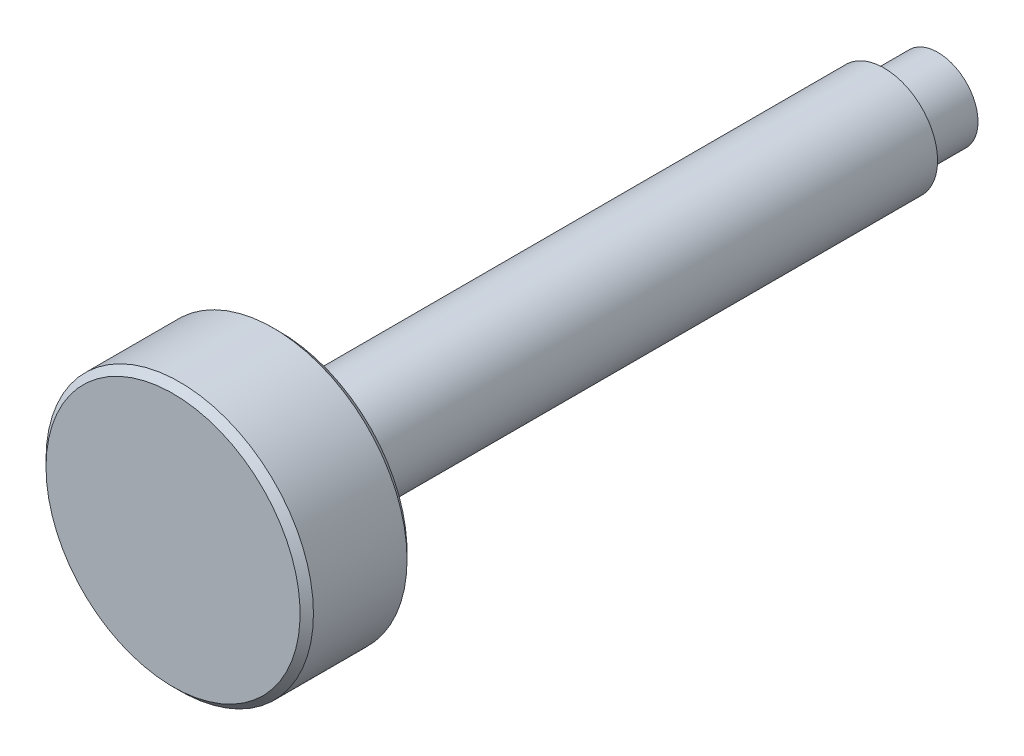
ISO-10303-21;
HEADER;
FILE_DESCRIPTION(('STEP AP214'),'2;1');
FILE_NAME('part.step','',(''),(''),'','','');
FILE_SCHEMA(('AUTOMOTIVE_DESIGN { 1 0 10303 214 1 1 1 1 }'));
ENDSEC;
DATA;
#1=APPLICATION_CONTEXT('core data for automotive mechanical design processes');
#2=APPLICATION_PROTOCOL_DEFINITION('international standard','automotive_design',2000,#1);
#3=PRODUCT_CONTEXT('',#1,'mechanical');
#4=PRODUCT('Part','Part','',(#3));
#5=PRODUCT_RELATED_PRODUCT_CATEGORY('part','',(#4));
#6=PRODUCT_DEFINITION_FORMATION('','',#4);
#7=PRODUCT_DEFINITION_CONTEXT('part definition',#1,'design');
#8=PRODUCT_DEFINITION('design','',#6,#7);
#9=PRODUCT_DEFINITION_SHAPE('','',#8);
#10=(LENGTH_UNIT() NAMED_UNIT(*) SI_UNIT(.MILLI.,.METRE.));
#11=(NAMED_UNIT(*) PLANE_ANGLE_UNIT() SI_UNIT($,.RADIAN.));
#12=(NAMED_UNIT(*) SI_UNIT($,.STERADIAN.) SOLID_ANGLE_UNIT());
#13=UNCERTAINTY_MEASURE_WITH_UNIT(LENGTH_MEASURE(1.E-05),#10,'distance_accuracy_value','');
#14=(GEOMETRIC_REPRESENTATION_CONTEXT(3) GLOBAL_UNCERTAINTY_ASSIGNED_CONTEXT((#13)) GLOBAL_UNIT_ASSIGNED_CONTEXT((#10,
#11,#12)) REPRESENTATION_CONTEXT('',''));
#15=CARTESIAN_POINT('',(0.,0.,0.));
#16=DIRECTION('',(0.,0.,1.));
#17=DIRECTION('',(1.,0.,0.));
#18=AXIS2_PLACEMENT_3D('',#15,#16,#17);
#19=CARTESIAN_POINT('',(0.,0.,100.));
#20=DIRECTION('',(0.,0.,1.));
#21=DIRECTION('',(1.,0.,0.));
#22=AXIS2_PLACEMENT_3D('',#19,#20,#21);
#23=CYLINDRICAL_SURFACE('',#22,20.);
#24=CARTESIAN_POINT('',(0.,0.,115.));
#25=DIRECTION('',(0.,0.,-1.));
#26=DIRECTION('',(-1.,0.,0.));
#27=AXIS2_PLACEMENT_3D('',#24,#25,#26);
#28=CIRCLE('',#27,20.);
#29=CARTESIAN_POINT('',(-20.,0.,115.));
#30=VERTEX_POINT('',#29);
#31=EDGE_CURVE('E23',#30,#30,#28,.T.);
#32=ORIENTED_EDGE('',*,*,#31,.T.);
#33=EDGE_LOOP('',(#32));
#34=FACE_BOUND('',#33,.T.);
#35=CARTESIAN_POINT('',(0.,0.,101.));
#36=DIRECTION('',(0.,0.,-1.));
#37=DIRECTION('',(-1.,0.,0.));
#38=AXIS2_PLACEMENT_3D('',#35,#36,#37);
#39=CIRCLE('',#38,20.);
#40=CARTESIAN_POINT('',(-20.,0.,101.));
#41=VERTEX_POINT('',#40);
#42=EDGE_CURVE('E27',#41,#41,#39,.F.);
#43=ORIENTED_EDGE('',*,*,#42,.T.);
#44=EDGE_LOOP('',(#43));
#45=FACE_BOUND('',#44,.T.);
#46=ADVANCED_FACE('F12',(#34,#45),#23,.T.);
#47=CARTESIAN_POINT('',(0.,0.,100.));
#48=DIRECTION('',(0.,0.,-1.));
#49=DIRECTION('',(-1.,0.,0.));
#50=AXIS2_PLACEMENT_3D('',#47,#48,#49);
#51=PLANE('',#50);
#52=CARTESIAN_POINT('',(0.,0.,100.));
#53=DIRECTION('',(0.,0.,-1.));
#54=DIRECTION('',(-1.,0.,0.));
#55=AXIS2_PLACEMENT_3D('',#52,#53,#54);
#56=CIRCLE('',#55,19.);
#57=CARTESIAN_POINT('',(-19.,0.,100.));
#58=VERTEX_POINT('',#57);
#59=EDGE_CURVE('E8',#58,#58,#56,.T.);
#60=ORIENTED_EDGE('',*,*,#59,.T.);
#61=EDGE_LOOP('',(#60));
#62=FACE_BOUND('',#61,.T.);
#63=CARTESIAN_POINT('',(0.,0.,100.));
#64=DIRECTION('',(0.,0.,-1.));
#65=DIRECTION('',(-1.,0.,0.));
#66=AXIS2_PLACEMENT_3D('',#63,#64,#65);
#67=CIRCLE('',#66,8.6);
#68=CARTESIAN_POINT('',(-8.6,0.,100.));
#69=VERTEX_POINT('',#68);
#70=EDGE_CURVE('E32',#69,#69,#67,.F.);
#71=ORIENTED_EDGE('',*,*,#70,.T.);
#72=EDGE_LOOP('',(#71));
#73=FACE_BOUND('',#72,.T.);
#74=ADVANCED_FACE('F66',(#62,#73),#51,.T.);
#75=CARTESIAN_POINT('',(0.,0.,116.));
#76=DIRECTION('',(0.,0.,-1.));
#77=DIRECTION('',(-1.,0.,0.));
#78=AXIS2_PLACEMENT_3D('',#75,#76,#77);
#79=PLANE('',#78);
#80=CARTESIAN_POINT('',(0.,0.,116.));
#81=DIRECTION('',(0.,0.,-1.));
#82=DIRECTION('',(-1.,0.,0.));
#83=AXIS2_PLACEMENT_3D('',#80,#81,#82);
#84=CIRCLE('',#83,19.);
#85=CARTESIAN_POINT('',(-19.,0.,116.));
#86=VERTEX_POINT('',#85);
#87=EDGE_CURVE('E19',#86,#86,#84,.F.);
#88=ORIENTED_EDGE('',*,*,#87,.T.);
#89=EDGE_LOOP('',(#88));
#90=FACE_BOUND('',#89,.T.);
#91=ADVANCED_FACE('F72',(#90),#79,.F.);
#92=CARTESIAN_POINT('',(0.,0.,100.));
#93=DIRECTION('',(0.,0.,1.));
#94=DIRECTION('',(1.,0.,0.));
#95=AXIS2_PLACEMENT_3D('',#92,#93,#94);
#96=CYLINDRICAL_SURFACE('',#95,8.);
#97=CARTESIAN_POINT('',(0.,0.,99.4));
#98=DIRECTION('',(0.,0.,-1.));
#99=DIRECTION('',(-1.,0.,0.));
#100=AXIS2_PLACEMENT_3D('',#97,#98,#99);
#101=CIRCLE('',#100,8.);
#102=CARTESIAN_POINT('',(-8.,0.,99.4));
#103=VERTEX_POINT('',#102);
#104=EDGE_CURVE('E35',#103,#103,#101,.T.);
#105=ORIENTED_EDGE('',*,*,#104,.T.);
#106=EDGE_LOOP('',(#105));
#107=FACE_BOUND('',#106,.T.);
#108=CARTESIAN_POINT('',(0.,0.,9.65470053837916));
#109=DIRECTION('',(0.,0.,1.));
#110=DIRECTION('',(1.,0.,0.));
#111=AXIS2_PLACEMENT_3D('',#108,#109,#110);
#112=CIRCLE('',#111,8.);
#113=CARTESIAN_POINT('',(8.,0.,9.65470053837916));
#114=VERTEX_POINT('',#113);
#115=EDGE_CURVE('E38',#114,#114,#112,.T.);
#116=ORIENTED_EDGE('',*,*,#115,.T.);
#117=EDGE_LOOP('',(#116));
#118=FACE_BOUND('',#117,.T.);
#119=ADVANCED_FACE('F125',(#107,#118),#96,.T.);
#120=CARTESIAN_POINT('',(0.,0.,9.65470053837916));
#121=DIRECTION('',(0.,0.,1.));
#122=DIRECTION('',(1.,0.,0.));
#123=AXIS2_PLACEMENT_3D('',#120,#121,#122);
#124=CONICAL_SURFACE('',#123,8.,1.0471975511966);
#125=CARTESIAN_POINT('',(0.,0.,8.5));
#126=DIRECTION('',(0.,0.,1.));
#127=DIRECTION('',(1.,0.,0.));
#128=AXIS2_PLACEMENT_3D('',#125,#126,#127);
#129=CIRCLE('',#128,6.);
#130=CARTESIAN_POINT('',(6.,0.,8.5));
#131=VERTEX_POINT('',#130);
#132=EDGE_CURVE('E41',#131,#131,#129,.T.);
#133=ORIENTED_EDGE('',*,*,#132,.T.);
#134=EDGE_LOOP('',(#133));
#135=FACE_BOUND('',#134,.T.);
#136=ORIENTED_EDGE('',*,*,#115,.F.);
#137=EDGE_LOOP('',(#136));
#138=FACE_BOUND('',#137,.T.);
#139=ADVANCED_FACE('F63',(#135,#138),#124,.T.);
#140=CARTESIAN_POINT('',(0.,0.,100.));
#141=DIRECTION('',(0.,0.,1.));
#142=DIRECTION('',(1.,0.,0.));
#143=AXIS2_PLACEMENT_3D('',#140,#141,#142);
#144=CYLINDRICAL_SURFACE('',#143,6.);
#145=CARTESIAN_POINT('',(0.,0.,1.60769515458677));
#146=DIRECTION('',(0.,0.,1.));
#147=DIRECTION('',(1.,0.,0.));
#148=AXIS2_PLACEMENT_3D('',#145,#146,#147);
#149=CIRCLE('',#148,6.);
#150=CARTESIAN_POINT('',(6.,0.,1.60769515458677));
#151=VERTEX_POINT('',#150);
#152=EDGE_CURVE('E44',#151,#151,#149,.T.);
#153=ORIENTED_EDGE('',*,*,#152,.T.);
#154=EDGE_LOOP('',(#153));
#155=FACE_BOUND('',#154,.T.);
#156=ORIENTED_EDGE('',*,*,#132,.F.);
#157=EDGE_LOOP('',(#156));
#158=FACE_BOUND('',#157,.T.);
#159=ADVANCED_FACE('F48',(#155,#158),#144,.T.);
#160=CARTESIAN_POINT('',(0.,0.,12.));
#161=DIRECTION('',(0.,0.,1.));
#162=DIRECTION('',(1.,0.,0.));
#163=AXIS2_PLACEMENT_3D('',#160,#161,#162);
#164=SPHERICAL_SURFACE('',#163,12.);
#165=ORIENTED_EDGE('',*,*,#152,.F.);
#166=EDGE_LOOP('',(#165));
#167=FACE_BOUND('',#166,.T.);
#168=ADVANCED_FACE('F51',(#167),#164,.T.);
#169=CARTESIAN_POINT('',(0.,0.,99.4));
#170=DIRECTION('',(0.,0.,-1.));
#171=DIRECTION('',(-1.,0.,0.));
#172=AXIS2_PLACEMENT_3D('',#169,#170,#171);
#173=TOROIDAL_SURFACE('',#172,8.6,0.6);
#174=ORIENTED_EDGE('',*,*,#70,.F.);
#175=EDGE_LOOP('',(#174));
#176=FACE_BOUND('',#175,.T.);
#177=ORIENTED_EDGE('',*,*,#104,.F.);
#178=EDGE_LOOP('',(#177));
#179=FACE_BOUND('',#178,.T.);
#180=ADVANCED_FACE('F53',(#176,#179),#173,.F.);
#181=CARTESIAN_POINT('',(0.,0.,115.));
#182=DIRECTION('',(0.,0.,-1.));
#183=DIRECTION('',(-1.,0.,0.));
#184=AXIS2_PLACEMENT_3D('',#181,#182,#183);
#185=CONICAL_SURFACE('',#184,20.,0.785398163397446);
#186=ORIENTED_EDGE('',*,*,#87,.F.);
#187=EDGE_LOOP('',(#186));
#188=FACE_BOUND('',#187,.T.);
#189=ORIENTED_EDGE('',*,*,#31,.F.);
#190=EDGE_LOOP('',(#189));
#191=FACE_BOUND('',#190,.T.);
#192=ADVANCED_FACE('F60',(#188,#191),#185,.T.);
#193=CARTESIAN_POINT('',(0.,0.,100.));
#194=DIRECTION('',(0.,0.,1.));
#195=DIRECTION('',(1.,0.,0.));
#196=AXIS2_PLACEMENT_3D('',#193,#194,#195);
#197=CONICAL_SURFACE('',#196,19.,0.78539816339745);
#198=ORIENTED_EDGE('',*,*,#42,.F.);
#199=EDGE_LOOP('',(#198));
#200=FACE_BOUND('',#199,.T.);
#201=ORIENTED_EDGE('',*,*,#59,.F.);
#202=EDGE_LOOP('',(#201));
#203=FACE_BOUND('',#202,.T.);
#204=ADVANCED_FACE('F14',(#200,#203),#197,.T.);
#205=CLOSED_SHELL('',(#46,#74,#91,#119,#139,#159,#168,#180,#192,#204));
#206=MANIFOLD_SOLID_BREP('B1',#205);
#207=ADVANCED_BREP_SHAPE_REPRESENTATION('',(#18,#206),#14);
#208=SHAPE_DEFINITION_REPRESENTATION(#9,#207);
ENDSEC;
END-ISO-10303-21;
